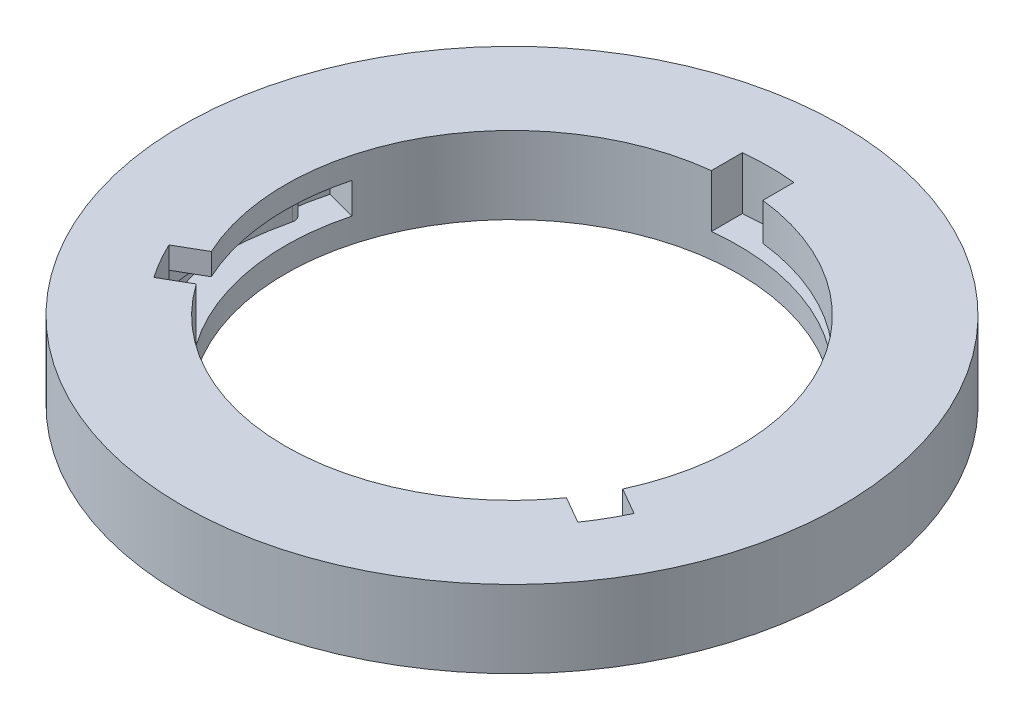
from build123d import *

# Parameters (mm, degrees)
ESQUISSE2_W                             = 20
ESQUISSE2_H                             = 15
ENL_V_START                             = -10.25
ENL_V_MAT_EXTRU_1_DEPTH                 = 10.25
ENL_V_MAT_EXTRU_2_DEPTH                 = 10.25
R_P_TITION_CIRCULAIRE1_COUNT            = 2
R_P_TITION_CIRCULAIRE1_ANGLE            = 120
ESQUISSE6_W                             = 6
ESQUISSE6_H                             = 3
ENL_VEMENT_DE_MATI_RE_R_VOLUTION1_ANGLE = 45
R_P_TITION_CIRCULAIRE2_COUNT            = 3
ENL_V_MAT_EXTRU_3_DEPTH                 = 3
ESQUISSE10_W                            = 6
ESQUISSE10_H                            = 3
ENL_VEMENT_DE_MATI_RE_R_VOLUTION2_ANGLE = 10.56
ENL_V_MAT_EXTRU_4_DEPTH                 = 3
R_P_TITION_CIRCULAIRE3_COUNT            = 2
R_P_TITION_CIRCULAIRE3_ANGLE            = 120


with BuildPart() as part:
    # Esquisse2 → R_volution3 (revolve)
    with BuildSketch(Plane.XY, mode=Mode.PRIVATE) as r_volution3_sk:
        with Locations((54, 7.5)):
            Rectangle(ESQUISSE2_W, ESQUISSE2_H)
    revolve(r_volution3_sk.sketch.rotate(Axis((0, 40.307612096, 0), (0, -1, 0)), 90), axis=Axis((0, 40.307612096, 0), (0, -1, 0)))

    # Esquisse4 → Enl_v. mat.-Extru.1 (cut)
    with BuildSketch(Plane(origin=(0, 15, 0), x_dir=(1, 0, 0), z_dir=(0, 1, 0)).offset(ENL_V_START)):
        with BuildLine():
            Line((5, 49.749371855), (5, 43.714985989))
            ThreePointArc((5, 43.714985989), (0, 44), (-5, 43.714985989))
            Line((-5, 43.714985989), (-5, 49.749371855))
            ThreePointArc((-5, 49.749371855), (0, 50), (5, 49.749371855))
        make_face()
    extrude(amount=ENL_V_MAT_EXTRU_1_DEPTH, mode=Mode.SUBTRACT)

    # Esquisse5 → Enl_v. mat.-Extru.2 (cut)
    with BuildSketch(Plane(origin=(0, 15, 0), x_dir=(1, 0, 0), z_dir=(0, 1, 0)).offset(ENL_V_START)):
        with BuildLine():
            Line((-45.16248371, -21.455769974), (-39.947331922, -18.444800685))
            ThreePointArc((-39.947331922, -18.444800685), (-38.105117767, -22), (-35.947331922, -25.373003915))
            Line((-35.947331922, -25.373003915), (-41.16248371, -28.383973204))
            ThreePointArc((-41.16248371, -28.383973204), (-43.301270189, -25), (-45.16248371, -21.455769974))
        make_face()
    enl_v_mat_extru_2 = extrude(amount=ENL_V_MAT_EXTRU_2_DEPTH, mode=Mode.SUBTRACT)

    # R_p_tition circulaire1: Enl_v. mat.-Extru.2 ×2 about axis
    r_p_tition_circulaire1_axis = Axis((0, 0, 0), (0, 1, 0))
    for i in range(1, R_P_TITION_CIRCULAIRE1_COUNT):
        add(enl_v_mat_extru_2.rotate(r_p_tition_circulaire1_axis, i * R_P_TITION_CIRCULAIRE1_ANGLE / (R_P_TITION_CIRCULAIRE1_COUNT - 1)), mode=Mode.SUBTRACT)

    # Esquisse6 → Enl_vement de mati_re-R_volution1 (revolve, cut)
    with BuildSketch(Plane.ZY):
        with Locations((-47, 6.25)):
            Rectangle(ESQUISSE6_W, ESQUISSE6_H)
    enl_vement_de_mati_re_r_volution1 = revolve(axis=Axis((0, 40.307612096, 0), (0, -1, 0)), revolution_arc=ENL_VEMENT_DE_MATI_RE_R_VOLUTION1_ANGLE, mode=Mode.SUBTRACT)

    # R_p_tition circulaire2: Enl_vement de mati_re-R_volution1 ×3 about axis
    r_p_tition_circulaire2_axis = Axis((0, 0, 0), (0, 1, 0))
    for i in range(1, R_P_TITION_CIRCULAIRE2_COUNT):
        add(enl_vement_de_mati_re_r_volution1.rotate(r_p_tition_circulaire2_axis, i * 360 / R_P_TITION_CIRCULAIRE2_COUNT), mode=Mode.SUBTRACT)

    # Esquisse9 → Enl_v. mat.-Extru.3 (cut)
    with BuildSketch(Plane.XZ.offset(-7.75)):
        with BuildLine():
            Line((41.16248371, 28.383973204), (35.947331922, 25.373003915))
            ThreePointArc((35.947331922, 25.373003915), (28.384496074, 33.620237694), (18.985855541, 39.693038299))
            ThreePointArc((18.985855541, 39.693038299), (30.667129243, 35.201276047), (41.16248371, 28.383973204))
        make_face()
    enl_v_mat_extru_3 = extrude(amount=-ENL_V_MAT_EXTRU_3_DEPTH, mode=Mode.SUBTRACT)

    # Esquisse10 → Enl_vement de mati_re-R_volution2 (revolve, cut)
    with BuildSketch(Plane(origin=(0, 0, 0), x_dir=(-0.2588190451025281, 0, -0.9659258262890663), z_dir=(0.9659258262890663, 0, -0.2588190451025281))):
        with Locations((-47, 9.25)):
            Rectangle(ESQUISSE10_W, ESQUISSE10_H)
    enl_vement_de_mati_re_r_volution2 = revolve(axis=Axis((0, 40.307612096, 0), (0, 1, 0)), revolution_arc=ENL_VEMENT_DE_MATI_RE_R_VOLUTION2_ANGLE, mode=Mode.SUBTRACT)

    # Esquisse12 → Enl_v. mat.-Extru.4 (cut)
    with BuildSketch(Plane.XZ.offset(-7.75)):
        with BuildLine():
            Line((19.750721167, 41.296897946), (18.98406601, 39.693894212))
            Line((18.98406601, 39.693894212), (18.985855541, 39.693038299))
            ThreePointArc((18.985855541, 39.693038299), (19.830856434, 39.45924994), (20.672350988, 39.213139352))
            ThreePointArc((20.672350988, 39.213139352), (19.732111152, 40.042972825), (19.750721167, 41.296897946))
        make_face()
    enl_v_mat_extru_4 = extrude(amount=-ENL_V_MAT_EXTRU_4_DEPTH, mode=Mode.SUBTRACT)

    # R_p_tition circulaire3: Enl_v. mat.-Extru.3, Enl_vement de mati_re-R_volution2, Enl_v. mat.-Extru.4 ×2 about axis
    r_p_tition_circulaire3_axis = Axis((0, 0, 0), (0, -1, 0))
    add([enl_v_mat_extru_3.rotate(r_p_tition_circulaire3_axis, i * R_P_TITION_CIRCULAIRE3_ANGLE / (R_P_TITION_CIRCULAIRE3_COUNT - 1)) for i in range(1, R_P_TITION_CIRCULAIRE3_COUNT)], mode=Mode.SUBTRACT)
    add([enl_vement_de_mati_re_r_volution2.rotate(r_p_tition_circulaire3_axis, i * R_P_TITION_CIRCULAIRE3_ANGLE / (R_P_TITION_CIRCULAIRE3_COUNT - 1)) for i in range(1, R_P_TITION_CIRCULAIRE3_COUNT)], mode=Mode.SUBTRACT)
    add([enl_v_mat_extru_4.rotate(r_p_tition_circulaire3_axis, i * R_P_TITION_CIRCULAIRE3_ANGLE / (R_P_TITION_CIRCULAIRE3_COUNT - 1)) for i in range(1, R_P_TITION_CIRCULAIRE3_COUNT)], mode=Mode.SUBTRACT)


solid = part.part
